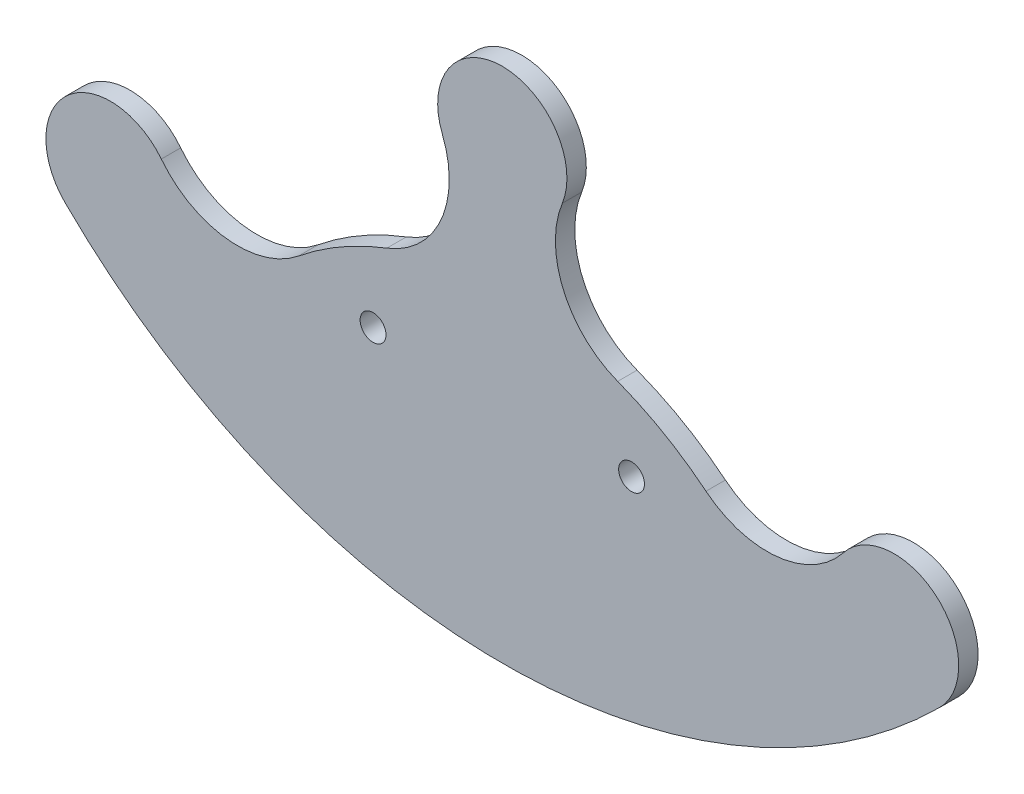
from build123d import *

# Parameters (mm, degrees)
SKETCH2_R      = 2
EXTRUDE1_DEPTH = 3


with BuildPart() as part:
    # Sketch2 → Extrude1 (new body)
    with BuildSketch(Plane.XY):
        with BuildLine():
            ThreePointArc((-17.855029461, 46.703296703), (-25, 43.301270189), (-31.518726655, 38.81455745))
            ThreePointArc((-31.518726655, 38.81455745), (-42.636750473, 35.551329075), (-52.76280482, 41.183569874))
            ThreePointArc((-52.76280482, 41.183569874), (-67.272415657, 42.467865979), (-67.670822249, 27.906976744))
            ThreePointArc((-67.670822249, 27.906976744), (0, 0), (67.670822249, 27.906976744))
            ThreePointArc((67.670822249, 27.906976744), (67.272415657, 42.467865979), (52.76280482, 41.183569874))
            ThreePointArc((52.76280482, 41.183569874), (42.636750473, 35.551329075), (31.518726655, 38.81455745))
            ThreePointArc((31.518726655, 38.81455745), (25, 43.301270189), (17.855029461, 46.703296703))
            ThreePointArc((17.855029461, 46.703296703), (9.46997888, 54.700173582), (9.28461532, 66.285714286))
            ThreePointArc((9.28461532, 66.285714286), (0, 80), (-9.28461532, 66.285714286))
            ThreePointArc((-9.28461532, 66.285714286), (-9.46997888, 54.700173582), (-17.855029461, 46.703296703))
        make_face()
        with Locations((-20, 35)):
            Circle(SKETCH2_R, mode=Mode.SUBTRACT)
        with Locations((20, 35)):
            Circle(SKETCH2_R, mode=Mode.SUBTRACT)
    extrude(amount=EXTRUDE1_DEPTH)


solid = part.part
